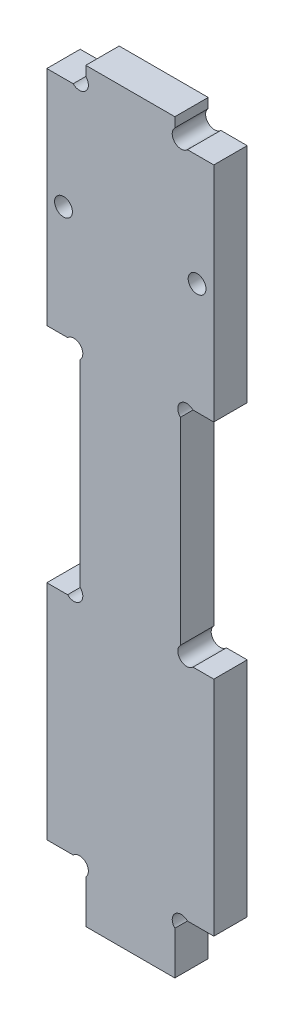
from build123d import *

# Parameters (mm, degrees)
ESQUISSE1_R      = 1.6
EXTRUSION1_DEPTH = 6


with BuildPart() as part:
    # Esquisse1 → Extrusion1 (new body)
    with BuildSketch(Plane.XY):
        with BuildLine():
            Line((25.2627417, 10), (30, 10))
            Line((30, 10), (30, 50))
            Line((30, 50), (26.2627417, 50))
            ThreePointArc((26.2627417, 50), (24, 50), (24, 52.2627417))
            Line((24, 52.2627417), (24, 87.7372583))
            ThreePointArc((24, 87.7372583), (24, 90), (26.2627417, 90))
            Line((26.2627417, 90), (30, 90))
            Line((30, 90), (30, 130))
            Line((30, 130), (25.2627417, 130))
            ThreePointArc((25.2627417, 130), (23, 130), (23, 132.2627417))
            Line((23, 132.2627417), (23, 134))
            Line((23, 134), (7, 134))
            Line((7, 134), (7, 132.2627417))
            ThreePointArc((7, 132.2627417), (7, 130), (4.7372583, 130))
            Line((4.7372583, 130), (0, 130))
            Line((0, 130), (0, 90))
            Line((0, 90), (3.7372583, 90))
            ThreePointArc((3.7372583, 90), (6, 90), (6, 87.7372583))
            Line((6, 87.7372583), (6, 52.2627417))
            ThreePointArc((6, 52.2627417), (6, 50), (3.7372583, 50))
            Line((3.7372583, 50), (0, 50))
            Line((0, 50), (0, 10))
            Line((0, 10), (4.7372583, 10))
            ThreePointArc((4.7372583, 10), (7, 10), (7, 7.7372583))
            Line((7, 7.7372583), (7, 0))
            Line((7, 0), (23, 0))
            Line((23, 0), (23, 7.7372583))
            ThreePointArc((23, 7.7372583), (23, 10), (25.2627417, 10))
        make_face()
        with Locations(Location((27, 110, 0), (0, 0, 180))):
            Circle(ESQUISSE1_R, mode=Mode.SUBTRACT)
        with Locations((3, 110)):
            Circle(ESQUISSE1_R, mode=Mode.SUBTRACT)
    extrude(amount=EXTRUSION1_DEPTH)


solid = part.part
